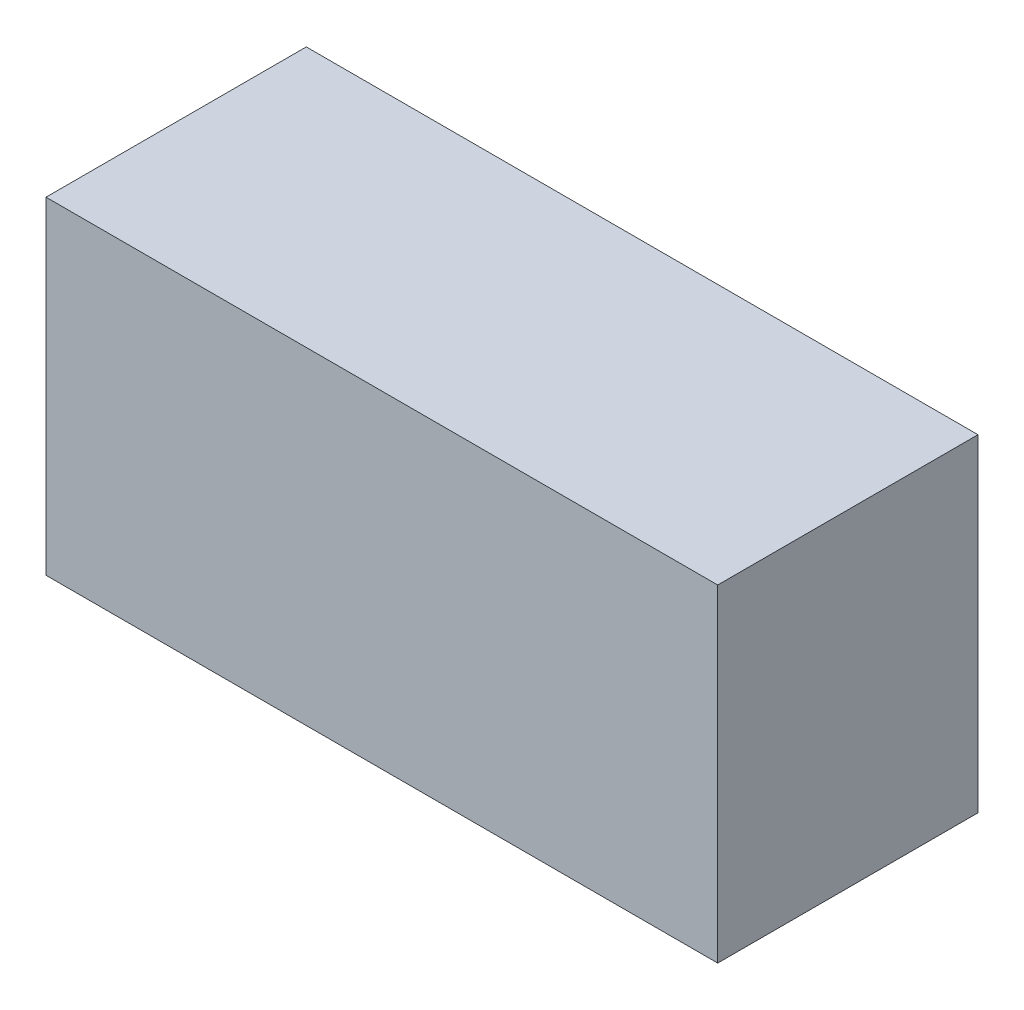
from build123d import *

# Parameters (mm, degrees)
CROQUIS1_W              = 15.5
CROQUIS1_H              = 19.5
SALIENTE_EXTRUIR1_DEPTH = 40


with BuildPart() as part:
    # Croquis1 → Saliente-Extruir1 (new body)
    with BuildSketch(Plane(origin=(0, 0, 0), x_dir=(0, 0, -1), z_dir=(1, 0, 0))):
        Rectangle(CROQUIS1_W, CROQUIS1_H)
    extrude(amount=SALIENTE_EXTRUIR1_DEPTH)


solid = part.part
